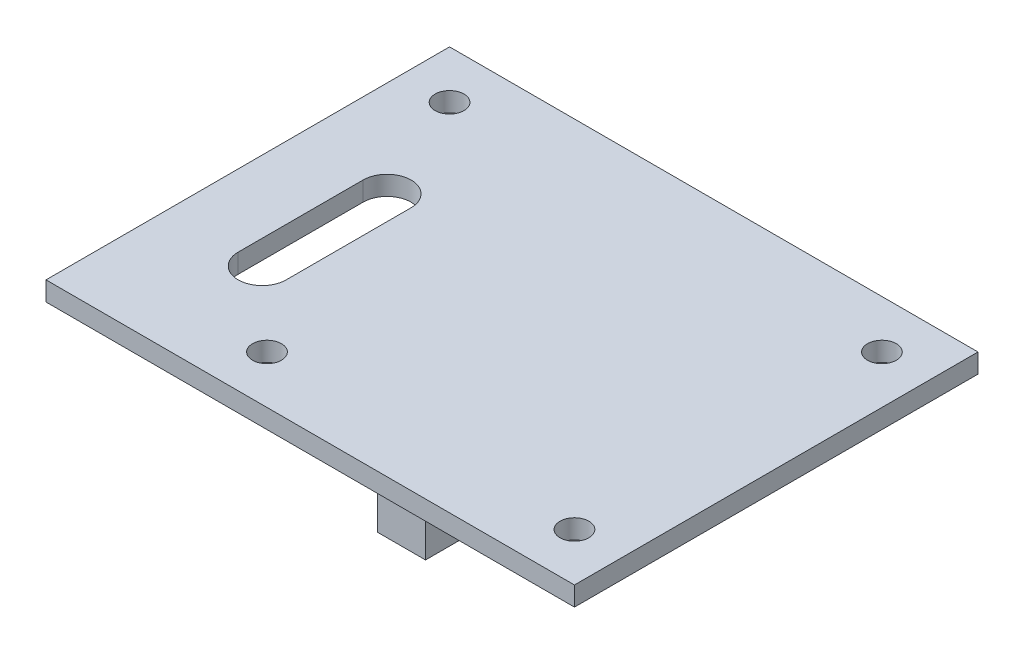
ISO-10303-21;
HEADER;
FILE_DESCRIPTION(('STEP AP214'),'2;1');
FILE_NAME('part.step','',(''),(''),'','','');
FILE_SCHEMA(('AUTOMOTIVE_DESIGN { 1 0 10303 214 1 1 1 1 }'));
ENDSEC;
DATA;
#1=APPLICATION_CONTEXT('core data for automotive mechanical design processes');
#2=APPLICATION_PROTOCOL_DEFINITION('international standard','automotive_design',2000,#1);
#3=PRODUCT_CONTEXT('',#1,'mechanical');
#4=PRODUCT('Part','Part','',(#3));
#5=PRODUCT_RELATED_PRODUCT_CATEGORY('part','',(#4));
#6=PRODUCT_DEFINITION_FORMATION('','',#4);
#7=PRODUCT_DEFINITION_CONTEXT('part definition',#1,'design');
#8=PRODUCT_DEFINITION('design','',#6,#7);
#9=PRODUCT_DEFINITION_SHAPE('','',#8);
#10=(LENGTH_UNIT() NAMED_UNIT(*) SI_UNIT(.MILLI.,.METRE.));
#11=(NAMED_UNIT(*) PLANE_ANGLE_UNIT() SI_UNIT($,.RADIAN.));
#12=(NAMED_UNIT(*) SI_UNIT($,.STERADIAN.) SOLID_ANGLE_UNIT());
#13=UNCERTAINTY_MEASURE_WITH_UNIT(LENGTH_MEASURE(1.E-05),#10,'distance_accuracy_value','');
#14=(GEOMETRIC_REPRESENTATION_CONTEXT(3) GLOBAL_UNCERTAINTY_ASSIGNED_CONTEXT((#13)) GLOBAL_UNIT_ASSIGNED_CONTEXT((#10,
#11,#12)) REPRESENTATION_CONTEXT('',''));
#15=CARTESIAN_POINT('',(0.,0.,0.));
#16=DIRECTION('',(0.,0.,1.));
#17=DIRECTION('',(1.,0.,0.));
#18=AXIS2_PLACEMENT_3D('',#15,#16,#17);
#19=CARTESIAN_POINT('',(0.,0.,0.));
#20=DIRECTION('',(0.,-1.,0.));
#21=DIRECTION('',(0.,0.,-1.));
#22=AXIS2_PLACEMENT_3D('',#19,#20,#21);
#23=PLANE('',#22);
#24=CARTESIAN_POINT('',(50.,0.,-37.));
#25=DIRECTION('',(0.,1.,0.));
#26=DIRECTION('',(0.,0.,1.));
#27=AXIS2_PLACEMENT_3D('',#24,#25,#26);
#28=CIRCLE('',#27,1.5);
#29=CARTESIAN_POINT('',(50.,0.,-35.5));
#30=VERTEX_POINT('',#29);
#31=EDGE_CURVE('E242',#30,#30,#28,.T.);
#32=ORIENTED_EDGE('',*,*,#31,.T.);
#33=EDGE_LOOP('',(#32));
#34=FACE_BOUND('',#33,.T.);
#35=CARTESIAN_POINT('',(18.,0.,-4.99999999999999));
#36=DIRECTION('',(0.,1.,0.));
#37=DIRECTION('',(0.,0.,1.));
#38=AXIS2_PLACEMENT_3D('',#35,#36,#37);
#39=CIRCLE('',#38,1.5);
#40=CARTESIAN_POINT('',(18.,0.,-3.49999999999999));
#41=VERTEX_POINT('',#40);
#42=EDGE_CURVE('E254',#41,#41,#39,.T.);
#43=ORIENTED_EDGE('',*,*,#42,.T.);
#44=EDGE_LOOP('',(#43));
#45=FACE_BOUND('',#44,.T.);
#46=CARTESIAN_POINT('',(50.,0.,-5.));
#47=DIRECTION('',(0.,1.,0.));
#48=DIRECTION('',(0.,0.,1.));
#49=AXIS2_PLACEMENT_3D('',#46,#47,#48);
#50=CIRCLE('',#49,1.5);
#51=CARTESIAN_POINT('',(50.,0.,-3.49999999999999));
#52=VERTEX_POINT('',#51);
#53=EDGE_CURVE('E248',#52,#52,#50,.T.);
#54=ORIENTED_EDGE('',*,*,#53,.T.);
#55=EDGE_LOOP('',(#54));
#56=FACE_BOUND('',#55,.T.);
#57=CARTESIAN_POINT('',(5.,0.,-37.));
#58=DIRECTION('',(0.,1.,0.));
#59=DIRECTION('',(0.,0.,1.));
#60=AXIS2_PLACEMENT_3D('',#57,#58,#59);
#61=CIRCLE('',#60,1.5);
#62=CARTESIAN_POINT('',(5.,0.,-35.5));
#63=VERTEX_POINT('',#62);
#64=EDGE_CURVE('E238',#63,#63,#61,.T.);
#65=ORIENTED_EDGE('',*,*,#64,.T.);
#66=EDGE_LOOP('',(#65));
#67=FACE_BOUND('',#66,.T.);
#68=DIRECTION('',(0.,0.,-1.));
#69=VECTOR('',#68,1.);
#70=CARTESIAN_POINT('',(12.5,0.,-25.5));
#71=LINE('',#70,#69);
#72=CARTESIAN_POINT('',(12.5,0.,-12.5));
#73=VERTEX_POINT('',#72);
#74=CARTESIAN_POINT('',(12.5,0.,-25.5));
#75=VERTEX_POINT('',#74);
#76=EDGE_CURVE('E211',#73,#75,#71,.T.);
#77=ORIENTED_EDGE('',*,*,#76,.T.);
#78=CARTESIAN_POINT('',(10.,0.,-25.5));
#79=DIRECTION('',(0.,1.,0.));
#80=DIRECTION('',(0.,0.,1.));
#81=AXIS2_PLACEMENT_3D('',#78,#79,#80);
#82=CIRCLE('',#81,2.5);
#83=CARTESIAN_POINT('',(7.5,0.,-25.5));
#84=VERTEX_POINT('',#83);
#85=EDGE_CURVE('E207',#75,#84,#82,.T.);
#86=ORIENTED_EDGE('',*,*,#85,.T.);
#87=DIRECTION('',(0.,0.,1.));
#88=VECTOR('',#87,1.);
#89=CARTESIAN_POINT('',(7.5,0.,-25.5));
#90=LINE('',#89,#88);
#91=CARTESIAN_POINT('',(7.5,0.,-12.5));
#92=VERTEX_POINT('',#91);
#93=EDGE_CURVE('E221',#84,#92,#90,.T.);
#94=ORIENTED_EDGE('',*,*,#93,.T.);
#95=CARTESIAN_POINT('',(10.,0.,-12.4999999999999));
#96=DIRECTION('',(0.,1.,0.));
#97=DIRECTION('',(0.,0.,1.));
#98=AXIS2_PLACEMENT_3D('',#95,#96,#97);
#99=CIRCLE('',#98,2.5);
#100=EDGE_CURVE('E224',#92,#73,#99,.T.);
#101=ORIENTED_EDGE('',*,*,#100,.T.);
#102=EDGE_LOOP('',(#77,#86,#94,#101));
#103=FACE_BOUND('',#102,.T.);
#104=DIRECTION('',(0.,0.,1.));
#105=VECTOR('',#104,1.);
#106=CARTESIAN_POINT('',(31.,0.,0.));
#107=LINE('',#106,#105);
#108=CARTESIAN_POINT('',(31.,0.,-13.5));
#109=VERTEX_POINT('',#108);
#110=CARTESIAN_POINT('',(31.,0.,-8.5));
#111=VERTEX_POINT('',#110);
#112=EDGE_CURVE('E178',#109,#111,#107,.T.);
#113=ORIENTED_EDGE('',*,*,#112,.F.);
#114=DIRECTION('',(1.,0.,0.));
#115=VECTOR('',#114,1.);
#116=CARTESIAN_POINT('',(0.,0.,-13.5));
#117=LINE('',#116,#115);
#118=CARTESIAN_POINT('',(26.,0.,-13.5));
#119=VERTEX_POINT('',#118);
#120=EDGE_CURVE('E175',#119,#109,#117,.T.);
#121=ORIENTED_EDGE('',*,*,#120,.F.);
#122=DIRECTION('',(0.,0.,-1.));
#123=VECTOR('',#122,1.);
#124=CARTESIAN_POINT('',(26.,0.,0.));
#125=LINE('',#124,#123);
#126=CARTESIAN_POINT('',(26.,0.,-8.5));
#127=VERTEX_POINT('',#126);
#128=EDGE_CURVE('E188',#127,#119,#125,.T.);
#129=ORIENTED_EDGE('',*,*,#128,.F.);
#130=DIRECTION('',(-1.,0.,0.));
#131=VECTOR('',#130,1.);
#132=CARTESIAN_POINT('',(0.,0.,-8.5));
#133=LINE('',#132,#131);
#134=EDGE_CURVE('E196',#111,#127,#133,.T.);
#135=ORIENTED_EDGE('',*,*,#134,.F.);
#136=EDGE_LOOP('',(#113,#121,#129,#135));
#137=FACE_BOUND('',#136,.T.);
#138=DIRECTION('',(-1.,0.,0.));
#139=VECTOR('',#138,1.);
#140=CARTESIAN_POINT('',(0.,0.,-37.));
#141=LINE('',#140,#139);
#142=CARTESIAN_POINT('',(31.,0.,-37.));
#143=VERTEX_POINT('',#142);
#144=CARTESIAN_POINT('',(26.,0.,-37.));
#145=VERTEX_POINT('',#144);
#146=EDGE_CURVE('E297',#143,#145,#141,.T.);
#147=ORIENTED_EDGE('',*,*,#146,.F.);
#148=DIRECTION('',(0.,0.,1.));
#149=VECTOR('',#148,1.);
#150=CARTESIAN_POINT('',(31.,0.,0.));
#151=LINE('',#150,#149);
#152=CARTESIAN_POINT('',(31.,0.,-42.));
#153=VERTEX_POINT('',#152);
#154=EDGE_CURVE('E295',#153,#143,#151,.T.);
#155=ORIENTED_EDGE('',*,*,#154,.F.);
#156=DIRECTION('',(-1.,0.,0.));
#157=VECTOR('',#156,1.);
#158=CARTESIAN_POINT('',(0.,0.,-42.));
#159=LINE('',#158,#157);
#160=CARTESIAN_POINT('',(55.,0.,-42.));
#161=VERTEX_POINT('',#160);
#162=EDGE_CURVE('E174',#161,#153,#159,.T.);
#163=ORIENTED_EDGE('',*,*,#162,.F.);
#164=DIRECTION('',(0.,0.,-1.));
#165=VECTOR('',#164,1.);
#166=CARTESIAN_POINT('',(55.,0.,0.));
#167=LINE('',#166,#165);
#168=CARTESIAN_POINT('',(55.,0.,0.));
#169=VERTEX_POINT('',#168);
#170=EDGE_CURVE('E277',#169,#161,#167,.T.);
#171=ORIENTED_EDGE('',*,*,#170,.F.);
#172=DIRECTION('',(1.,0.,0.));
#173=VECTOR('',#172,1.);
#174=CARTESIAN_POINT('',(0.,0.,0.));
#175=LINE('',#174,#173);
#176=CARTESIAN_POINT('',(0.,0.,0.));
#177=VERTEX_POINT('',#176);
#178=EDGE_CURVE('E275',#177,#169,#175,.T.);
#179=ORIENTED_EDGE('',*,*,#178,.F.);
#180=DIRECTION('',(0.,0.,1.));
#181=VECTOR('',#180,1.);
#182=CARTESIAN_POINT('',(0.,0.,0.));
#183=LINE('',#182,#181);
#184=CARTESIAN_POINT('',(0.,0.,-42.));
#185=VERTEX_POINT('',#184);
#186=EDGE_CURVE('E260',#185,#177,#183,.T.);
#187=ORIENTED_EDGE('',*,*,#186,.F.);
#188=CARTESIAN_POINT('',(26.,0.,-42.));
#189=VERTEX_POINT('',#188);
#190=EDGE_CURVE('E279',#189,#185,#159,.T.);
#191=ORIENTED_EDGE('',*,*,#190,.F.);
#192=DIRECTION('',(0.,0.,-1.));
#193=VECTOR('',#192,1.);
#194=CARTESIAN_POINT('',(26.,0.,0.));
#195=LINE('',#194,#193);
#196=EDGE_CURVE('E168',#145,#189,#195,.T.);
#197=ORIENTED_EDGE('',*,*,#196,.F.);
#198=EDGE_LOOP('',(#147,#155,#163,#171,#179,#187,#191,#197));
#199=FACE_BOUND('',#198,.T.);
#200=ADVANCED_FACE('F38',(#34,#45,#56,#67,#103,#137,#199),#23,.T.);
#201=CARTESIAN_POINT('',(0.,2.,0.));
#202=DIRECTION('',(0.,-1.,0.));
#203=DIRECTION('',(0.,0.,-1.));
#204=AXIS2_PLACEMENT_3D('',#201,#202,#203);
#205=PLANE('',#204);
#206=CARTESIAN_POINT('',(5.,2.,-37.));
#207=DIRECTION('',(0.,1.,0.));
#208=DIRECTION('',(0.,0.,1.));
#209=AXIS2_PLACEMENT_3D('',#206,#207,#208);
#210=CIRCLE('',#209,1.5);
#211=CARTESIAN_POINT('',(5.,2.,-35.5));
#212=VERTEX_POINT('',#211);
#213=EDGE_CURVE('E239',#212,#212,#210,.T.);
#214=ORIENTED_EDGE('',*,*,#213,.F.);
#215=EDGE_LOOP('',(#214));
#216=FACE_BOUND('',#215,.T.);
#217=CARTESIAN_POINT('',(50.,2.,-37.));
#218=DIRECTION('',(0.,1.,0.));
#219=DIRECTION('',(0.,0.,1.));
#220=AXIS2_PLACEMENT_3D('',#217,#218,#219);
#221=CIRCLE('',#220,1.5);
#222=CARTESIAN_POINT('',(50.,2.,-35.5));
#223=VERTEX_POINT('',#222);
#224=EDGE_CURVE('E245',#223,#223,#221,.T.);
#225=ORIENTED_EDGE('',*,*,#224,.F.);
#226=EDGE_LOOP('',(#225));
#227=FACE_BOUND('',#226,.T.);
#228=CARTESIAN_POINT('',(50.,2.,-5.));
#229=DIRECTION('',(0.,1.,0.));
#230=DIRECTION('',(0.,0.,1.));
#231=AXIS2_PLACEMENT_3D('',#228,#229,#230);
#232=CIRCLE('',#231,1.5);
#233=CARTESIAN_POINT('',(50.,2.,-3.49999999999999));
#234=VERTEX_POINT('',#233);
#235=EDGE_CURVE('E251',#234,#234,#232,.T.);
#236=ORIENTED_EDGE('',*,*,#235,.F.);
#237=EDGE_LOOP('',(#236));
#238=FACE_BOUND('',#237,.T.);
#239=CARTESIAN_POINT('',(18.,2.,-4.99999999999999));
#240=DIRECTION('',(0.,1.,0.));
#241=DIRECTION('',(0.,0.,1.));
#242=AXIS2_PLACEMENT_3D('',#239,#240,#241);
#243=CIRCLE('',#242,1.5);
#244=CARTESIAN_POINT('',(18.,2.,-3.49999999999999));
#245=VERTEX_POINT('',#244);
#246=EDGE_CURVE('E257',#245,#245,#243,.T.);
#247=ORIENTED_EDGE('',*,*,#246,.F.);
#248=EDGE_LOOP('',(#247));
#249=FACE_BOUND('',#248,.T.);
#250=DIRECTION('',(0.,0.,1.));
#251=VECTOR('',#250,1.);
#252=CARTESIAN_POINT('',(0.,2.,0.));
#253=LINE('',#252,#251);
#254=CARTESIAN_POINT('',(0.,2.,-42.));
#255=VERTEX_POINT('',#254);
#256=CARTESIAN_POINT('',(0.,2.,0.));
#257=VERTEX_POINT('',#256);
#258=EDGE_CURVE('E263',#255,#257,#253,.T.);
#259=ORIENTED_EDGE('',*,*,#258,.T.);
#260=DIRECTION('',(1.,0.,0.));
#261=VECTOR('',#260,1.);
#262=CARTESIAN_POINT('',(0.,2.,0.));
#263=LINE('',#262,#261);
#264=CARTESIAN_POINT('',(55.,2.,0.));
#265=VERTEX_POINT('',#264);
#266=EDGE_CURVE('E266',#257,#265,#263,.T.);
#267=ORIENTED_EDGE('',*,*,#266,.T.);
#268=DIRECTION('',(0.,0.,-1.));
#269=VECTOR('',#268,1.);
#270=CARTESIAN_POINT('',(55.,2.,0.));
#271=LINE('',#270,#269);
#272=CARTESIAN_POINT('',(55.,2.,-42.));
#273=VERTEX_POINT('',#272);
#274=EDGE_CURVE('E268',#265,#273,#271,.T.);
#275=ORIENTED_EDGE('',*,*,#274,.T.);
#276=DIRECTION('',(-1.,0.,0.));
#277=VECTOR('',#276,1.);
#278=CARTESIAN_POINT('',(0.,2.,-42.));
#279=LINE('',#278,#277);
#280=EDGE_CURVE('E270',#273,#255,#279,.T.);
#281=ORIENTED_EDGE('',*,*,#280,.T.);
#282=EDGE_LOOP('',(#259,#267,#275,#281));
#283=FACE_BOUND('',#282,.T.);
#284=CARTESIAN_POINT('',(10.,2.,-25.5));
#285=DIRECTION('',(0.,1.,0.));
#286=DIRECTION('',(0.,0.,1.));
#287=AXIS2_PLACEMENT_3D('',#284,#285,#286);
#288=CIRCLE('',#287,2.5);
#289=CARTESIAN_POINT('',(12.5,2.,-25.5));
#290=VERTEX_POINT('',#289);
#291=CARTESIAN_POINT('',(7.5,2.,-25.5));
#292=VERTEX_POINT('',#291);
#293=EDGE_CURVE('E208',#290,#292,#288,.T.);
#294=ORIENTED_EDGE('',*,*,#293,.F.);
#295=DIRECTION('',(0.,0.,-1.));
#296=VECTOR('',#295,1.);
#297=CARTESIAN_POINT('',(12.5,2.,-25.5));
#298=LINE('',#297,#296);
#299=CARTESIAN_POINT('',(12.5,2.,-12.5));
#300=VERTEX_POINT('',#299);
#301=EDGE_CURVE('E216',#300,#290,#298,.T.);
#302=ORIENTED_EDGE('',*,*,#301,.F.);
#303=CARTESIAN_POINT('',(10.,2.,-12.4999999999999));
#304=DIRECTION('',(0.,1.,0.));
#305=DIRECTION('',(0.,0.,1.));
#306=AXIS2_PLACEMENT_3D('',#303,#304,#305);
#307=CIRCLE('',#306,2.5);
#308=CARTESIAN_POINT('',(7.5,2.,-12.5));
#309=VERTEX_POINT('',#308);
#310=EDGE_CURVE('E213',#309,#300,#307,.T.);
#311=ORIENTED_EDGE('',*,*,#310,.F.);
#312=DIRECTION('',(0.,0.,1.));
#313=VECTOR('',#312,1.);
#314=CARTESIAN_POINT('',(7.5,2.,-25.5));
#315=LINE('',#314,#313);
#316=EDGE_CURVE('E210',#292,#309,#315,.T.);
#317=ORIENTED_EDGE('',*,*,#316,.F.);
#318=EDGE_LOOP('',(#294,#302,#311,#317));
#319=FACE_BOUND('',#318,.T.);
#320=ADVANCED_FACE('F320',(#216,#227,#238,#249,#283,#319),#205,.F.);
#321=CARTESIAN_POINT('',(0.,2.,0.));
#322=DIRECTION('',(1.,0.,0.));
#323=DIRECTION('',(0.,0.,-1.));
#324=AXIS2_PLACEMENT_3D('',#321,#322,#323);
#325=PLANE('',#324);
#326=ORIENTED_EDGE('',*,*,#186,.T.);
#327=DIRECTION('',(0.,-1.,0.));
#328=VECTOR('',#327,1.);
#329=CARTESIAN_POINT('',(0.,2.,0.));
#330=LINE('',#329,#328);
#331=EDGE_CURVE('E11',#257,#177,#330,.T.);
#332=ORIENTED_EDGE('',*,*,#331,.F.);
#333=ORIENTED_EDGE('',*,*,#258,.F.);
#334=DIRECTION('',(0.,-1.,0.));
#335=VECTOR('',#334,1.);
#336=CARTESIAN_POINT('',(0.,2.,-42.));
#337=LINE('',#336,#335);
#338=EDGE_CURVE('E272',#255,#185,#337,.T.);
#339=ORIENTED_EDGE('',*,*,#338,.T.);
#340=EDGE_LOOP('',(#326,#332,#333,#339));
#341=FACE_BOUND('',#340,.T.);
#342=ADVANCED_FACE('F40',(#341),#325,.F.);
#343=CARTESIAN_POINT('',(0.,2.,0.));
#344=DIRECTION('',(0.,0.,-1.));
#345=DIRECTION('',(-1.,0.,0.));
#346=AXIS2_PLACEMENT_3D('',#343,#344,#345);
#347=PLANE('',#346);
#348=ORIENTED_EDGE('',*,*,#178,.T.);
#349=DIRECTION('',(0.,-1.,0.));
#350=VECTOR('',#349,1.);
#351=CARTESIAN_POINT('',(55.,2.,0.));
#352=LINE('',#351,#350);
#353=EDGE_CURVE('E46',#265,#169,#352,.T.);
#354=ORIENTED_EDGE('',*,*,#353,.F.);
#355=ORIENTED_EDGE('',*,*,#266,.F.);
#356=ORIENTED_EDGE('',*,*,#331,.T.);
#357=EDGE_LOOP('',(#348,#354,#355,#356));
#358=FACE_BOUND('',#357,.T.);
#359=ADVANCED_FACE('F322',(#358),#347,.F.);
#360=CARTESIAN_POINT('',(55.,2.,0.));
#361=DIRECTION('',(-1.,0.,0.));
#362=DIRECTION('',(0.,0.,1.));
#363=AXIS2_PLACEMENT_3D('',#360,#361,#362);
#364=PLANE('',#363);
#365=ORIENTED_EDGE('',*,*,#170,.T.);
#366=DIRECTION('',(0.,-1.,0.));
#367=VECTOR('',#366,1.);
#368=CARTESIAN_POINT('',(55.,2.,-42.));
#369=LINE('',#368,#367);
#370=EDGE_CURVE('E283',#273,#161,#369,.T.);
#371=ORIENTED_EDGE('',*,*,#370,.F.);
#372=ORIENTED_EDGE('',*,*,#274,.F.);
#373=ORIENTED_EDGE('',*,*,#353,.T.);
#374=EDGE_LOOP('',(#365,#371,#372,#373));
#375=FACE_BOUND('',#374,.T.);
#376=ADVANCED_FACE('F289',(#375),#364,.F.);
#377=CARTESIAN_POINT('',(0.,2.,-42.));
#378=DIRECTION('',(0.,0.,1.));
#379=DIRECTION('',(1.,0.,0.));
#380=AXIS2_PLACEMENT_3D('',#377,#378,#379);
#381=PLANE('',#380);
#382=ORIENTED_EDGE('',*,*,#162,.T.);
#383=DIRECTION('',(0.,1.,0.));
#384=VECTOR('',#383,1.);
#385=CARTESIAN_POINT('',(31.,-12.,-42.));
#386=LINE('',#385,#384);
#387=CARTESIAN_POINT('',(31.,-12.,-42.));
#388=VERTEX_POINT('',#387);
#389=EDGE_CURVE('E156',#388,#153,#386,.T.);
#390=ORIENTED_EDGE('',*,*,#389,.F.);
#391=DIRECTION('',(1.,0.,0.));
#392=VECTOR('',#391,1.);
#393=CARTESIAN_POINT('',(0.,-12.,-42.));
#394=LINE('',#393,#392);
#395=CARTESIAN_POINT('',(26.,-12.,-42.));
#396=VERTEX_POINT('',#395);
#397=EDGE_CURVE('E163',#396,#388,#394,.T.);
#398=ORIENTED_EDGE('',*,*,#397,.F.);
#399=DIRECTION('',(0.,1.,0.));
#400=VECTOR('',#399,1.);
#401=CARTESIAN_POINT('',(26.,-12.,-42.));
#402=LINE('',#401,#400);
#403=EDGE_CURVE('E53',#396,#189,#402,.T.);
#404=ORIENTED_EDGE('',*,*,#403,.T.);
#405=ORIENTED_EDGE('',*,*,#190,.T.);
#406=ORIENTED_EDGE('',*,*,#338,.F.);
#407=ORIENTED_EDGE('',*,*,#280,.F.);
#408=ORIENTED_EDGE('',*,*,#370,.T.);
#409=EDGE_LOOP('',(#382,#390,#398,#404,#405,#406,#407,#408));
#410=FACE_BOUND('',#409,.T.);
#411=ADVANCED_FACE('F171',(#410),#381,.F.);
#412=CARTESIAN_POINT('',(18.,2.,-4.99999999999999));
#413=DIRECTION('',(0.,-1.,0.));
#414=DIRECTION('',(0.,0.,-1.));
#415=AXIS2_PLACEMENT_3D('',#412,#413,#414);
#416=CYLINDRICAL_SURFACE('',#415,1.5);
#417=ORIENTED_EDGE('',*,*,#246,.T.);
#418=EDGE_LOOP('',(#417));
#419=FACE_BOUND('',#418,.T.);
#420=ORIENTED_EDGE('',*,*,#42,.F.);
#421=EDGE_LOOP('',(#420));
#422=FACE_BOUND('',#421,.T.);
#423=ADVANCED_FACE('F341',(#419,#422),#416,.F.);
#424=CARTESIAN_POINT('',(50.,2.,-5.));
#425=DIRECTION('',(0.,-1.,0.));
#426=DIRECTION('',(0.,0.,-1.));
#427=AXIS2_PLACEMENT_3D('',#424,#425,#426);
#428=CYLINDRICAL_SURFACE('',#427,1.5);
#429=ORIENTED_EDGE('',*,*,#235,.T.);
#430=EDGE_LOOP('',(#429));
#431=FACE_BOUND('',#430,.T.);
#432=ORIENTED_EDGE('',*,*,#53,.F.);
#433=EDGE_LOOP('',(#432));
#434=FACE_BOUND('',#433,.T.);
#435=ADVANCED_FACE('F345',(#431,#434),#428,.F.);
#436=CARTESIAN_POINT('',(50.,2.,-37.));
#437=DIRECTION('',(0.,-1.,0.));
#438=DIRECTION('',(0.,0.,-1.));
#439=AXIS2_PLACEMENT_3D('',#436,#437,#438);
#440=CYLINDRICAL_SURFACE('',#439,1.5);
#441=ORIENTED_EDGE('',*,*,#224,.T.);
#442=EDGE_LOOP('',(#441));
#443=FACE_BOUND('',#442,.T.);
#444=ORIENTED_EDGE('',*,*,#31,.F.);
#445=EDGE_LOOP('',(#444));
#446=FACE_BOUND('',#445,.T.);
#447=ADVANCED_FACE('F350',(#443,#446),#440,.F.);
#448=CARTESIAN_POINT('',(5.,2.,-37.));
#449=DIRECTION('',(0.,-1.,0.));
#450=DIRECTION('',(0.,0.,-1.));
#451=AXIS2_PLACEMENT_3D('',#448,#449,#450);
#452=CYLINDRICAL_SURFACE('',#451,1.5);
#453=ORIENTED_EDGE('',*,*,#213,.T.);
#454=EDGE_LOOP('',(#453));
#455=FACE_BOUND('',#454,.T.);
#456=ORIENTED_EDGE('',*,*,#64,.F.);
#457=EDGE_LOOP('',(#456));
#458=FACE_BOUND('',#457,.T.);
#459=ADVANCED_FACE('F357',(#455,#458),#452,.F.);
#460=CARTESIAN_POINT('',(10.,2.,-25.5));
#461=DIRECTION('',(0.,-1.,0.));
#462=DIRECTION('',(0.,0.,-1.));
#463=AXIS2_PLACEMENT_3D('',#460,#461,#462);
#464=CYLINDRICAL_SURFACE('',#463,2.5);
#465=ORIENTED_EDGE('',*,*,#85,.F.);
#466=DIRECTION('',(0.,-1.,0.));
#467=VECTOR('',#466,1.);
#468=CARTESIAN_POINT('',(12.5,2.,-25.5));
#469=LINE('',#468,#467);
#470=EDGE_CURVE('E218',#290,#75,#469,.T.);
#471=ORIENTED_EDGE('',*,*,#470,.F.);
#472=ORIENTED_EDGE('',*,*,#293,.T.);
#473=DIRECTION('',(0.,-1.,0.));
#474=VECTOR('',#473,1.);
#475=CARTESIAN_POINT('',(7.5,2.,-25.5));
#476=LINE('',#475,#474);
#477=EDGE_CURVE('E235',#292,#84,#476,.T.);
#478=ORIENTED_EDGE('',*,*,#477,.T.);
#479=EDGE_LOOP('',(#465,#471,#472,#478));
#480=FACE_BOUND('',#479,.T.);
#481=ADVANCED_FACE('F361',(#480),#464,.F.);
#482=CARTESIAN_POINT('',(7.5,2.,-25.5));
#483=DIRECTION('',(1.,0.,0.));
#484=DIRECTION('',(0.,0.,-1.));
#485=AXIS2_PLACEMENT_3D('',#482,#483,#484);
#486=PLANE('',#485);
#487=ORIENTED_EDGE('',*,*,#93,.F.);
#488=ORIENTED_EDGE('',*,*,#477,.F.);
#489=ORIENTED_EDGE('',*,*,#316,.T.);
#490=DIRECTION('',(0.,-1.,0.));
#491=VECTOR('',#490,1.);
#492=CARTESIAN_POINT('',(7.5,2.,-12.5));
#493=LINE('',#492,#491);
#494=EDGE_CURVE('E233',#309,#92,#493,.T.);
#495=ORIENTED_EDGE('',*,*,#494,.T.);
#496=EDGE_LOOP('',(#487,#488,#489,#495));
#497=FACE_BOUND('',#496,.T.);
#498=ADVANCED_FACE('F365',(#497),#486,.T.);
#499=CARTESIAN_POINT('',(10.,2.,-12.4999999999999));
#500=DIRECTION('',(0.,-1.,0.));
#501=DIRECTION('',(0.,0.,-1.));
#502=AXIS2_PLACEMENT_3D('',#499,#500,#501);
#503=CYLINDRICAL_SURFACE('',#502,2.5);
#504=ORIENTED_EDGE('',*,*,#100,.F.);
#505=ORIENTED_EDGE('',*,*,#494,.F.);
#506=ORIENTED_EDGE('',*,*,#310,.T.);
#507=DIRECTION('',(0.,-1.,0.));
#508=VECTOR('',#507,1.);
#509=CARTESIAN_POINT('',(12.5,2.,-12.5));
#510=LINE('',#509,#508);
#511=EDGE_CURVE('E231',#300,#73,#510,.T.);
#512=ORIENTED_EDGE('',*,*,#511,.T.);
#513=EDGE_LOOP('',(#504,#505,#506,#512));
#514=FACE_BOUND('',#513,.T.);
#515=ADVANCED_FACE('F369',(#514),#503,.F.);
#516=CARTESIAN_POINT('',(12.5,2.,-25.5));
#517=DIRECTION('',(-1.,0.,0.));
#518=DIRECTION('',(0.,0.,1.));
#519=AXIS2_PLACEMENT_3D('',#516,#517,#518);
#520=PLANE('',#519);
#521=ORIENTED_EDGE('',*,*,#76,.F.);
#522=ORIENTED_EDGE('',*,*,#511,.F.);
#523=ORIENTED_EDGE('',*,*,#301,.T.);
#524=ORIENTED_EDGE('',*,*,#470,.T.);
#525=EDGE_LOOP('',(#521,#522,#523,#524));
#526=FACE_BOUND('',#525,.T.);
#527=ADVANCED_FACE('F373',(#526),#520,.T.);
#528=CARTESIAN_POINT('',(0.,-12.,-13.5));
#529=DIRECTION('',(0.,0.,1.));
#530=DIRECTION('',(1.,0.,0.));
#531=AXIS2_PLACEMENT_3D('',#528,#529,#530);
#532=PLANE('',#531);
#533=ORIENTED_EDGE('',*,*,#120,.T.);
#534=DIRECTION('',(0.,1.,0.));
#535=VECTOR('',#534,1.);
#536=CARTESIAN_POINT('',(31.,-12.,-13.5));
#537=LINE('',#536,#535);
#538=CARTESIAN_POINT('',(31.,-12.,-13.5));
#539=VERTEX_POINT('',#538);
#540=EDGE_CURVE('E205',#539,#109,#537,.T.);
#541=ORIENTED_EDGE('',*,*,#540,.F.);
#542=DIRECTION('',(1.,0.,0.));
#543=VECTOR('',#542,1.);
#544=CARTESIAN_POINT('',(0.,-12.,-13.5));
#545=LINE('',#544,#543);
#546=CARTESIAN_POINT('',(26.,-12.,-13.5));
#547=VERTEX_POINT('',#546);
#548=EDGE_CURVE('E184',#547,#539,#545,.T.);
#549=ORIENTED_EDGE('',*,*,#548,.F.);
#550=DIRECTION('',(0.,1.,0.));
#551=VECTOR('',#550,1.);
#552=CARTESIAN_POINT('',(26.,-12.,-13.5));
#553=LINE('',#552,#551);
#554=EDGE_CURVE('E193',#547,#119,#553,.T.);
#555=ORIENTED_EDGE('',*,*,#554,.T.);
#556=EDGE_LOOP('',(#533,#541,#549,#555));
#557=FACE_BOUND('',#556,.T.);
#558=ADVANCED_FACE('F377',(#557),#532,.F.);
#559=CARTESIAN_POINT('',(31.,-12.,0.));
#560=DIRECTION('',(-1.,0.,0.));
#561=DIRECTION('',(0.,0.,1.));
#562=AXIS2_PLACEMENT_3D('',#559,#560,#561);
#563=PLANE('',#562);
#564=CARTESIAN_POINT('',(31.,-6.,-11.));
#565=DIRECTION('',(-1.,0.,0.));
#566=DIRECTION('',(0.,0.,1.));
#567=AXIS2_PLACEMENT_3D('',#564,#565,#566);
#568=CIRCLE('',#567,1.);
#569=CARTESIAN_POINT('',(31.,-6.,-10.));
#570=VERTEX_POINT('',#569);
#571=EDGE_CURVE('E298',#570,#570,#568,.T.);
#572=ORIENTED_EDGE('',*,*,#571,.T.);
#573=EDGE_LOOP('',(#572));
#574=FACE_BOUND('',#573,.T.);
#575=ORIENTED_EDGE('',*,*,#112,.T.);
#576=DIRECTION('',(0.,1.,0.));
#577=VECTOR('',#576,1.);
#578=CARTESIAN_POINT('',(31.,-12.,-8.5));
#579=LINE('',#578,#577);
#580=CARTESIAN_POINT('',(31.,-12.,-8.5));
#581=VERTEX_POINT('',#580);
#582=EDGE_CURVE('E202',#581,#111,#579,.T.);
#583=ORIENTED_EDGE('',*,*,#582,.F.);
#584=DIRECTION('',(0.,0.,1.));
#585=VECTOR('',#584,1.);
#586=CARTESIAN_POINT('',(31.,-12.,0.));
#587=LINE('',#586,#585);
#588=EDGE_CURVE('E187',#539,#581,#587,.T.);
#589=ORIENTED_EDGE('',*,*,#588,.F.);
#590=ORIENTED_EDGE('',*,*,#540,.T.);
#591=EDGE_LOOP('',(#575,#583,#589,#590));
#592=FACE_BOUND('',#591,.T.);
#593=ADVANCED_FACE('F381',(#574,#592),#563,.F.);
#594=CARTESIAN_POINT('',(0.,-12.,-8.5));
#595=DIRECTION('',(0.,0.,-1.));
#596=DIRECTION('',(-1.,0.,0.));
#597=AXIS2_PLACEMENT_3D('',#594,#595,#596);
#598=PLANE('',#597);
#599=ORIENTED_EDGE('',*,*,#134,.T.);
#600=DIRECTION('',(0.,1.,0.));
#601=VECTOR('',#600,1.);
#602=CARTESIAN_POINT('',(26.,-12.,-8.5));
#603=LINE('',#602,#601);
#604=CARTESIAN_POINT('',(26.,-12.,-8.5));
#605=VERTEX_POINT('',#604);
#606=EDGE_CURVE('E61',#605,#127,#603,.T.);
#607=ORIENTED_EDGE('',*,*,#606,.F.);
#608=DIRECTION('',(-1.,0.,0.));
#609=VECTOR('',#608,1.);
#610=CARTESIAN_POINT('',(0.,-12.,-8.5));
#611=LINE('',#610,#609);
#612=EDGE_CURVE('E190',#581,#605,#611,.T.);
#613=ORIENTED_EDGE('',*,*,#612,.F.);
#614=ORIENTED_EDGE('',*,*,#582,.T.);
#615=EDGE_LOOP('',(#599,#607,#613,#614));
#616=FACE_BOUND('',#615,.T.);
#617=ADVANCED_FACE('F385',(#616),#598,.F.);
#618=CARTESIAN_POINT('',(26.,-12.,0.));
#619=DIRECTION('',(1.,0.,0.));
#620=DIRECTION('',(0.,0.,-1.));
#621=AXIS2_PLACEMENT_3D('',#618,#619,#620);
#622=PLANE('',#621);
#623=CARTESIAN_POINT('',(26.,-6.,-11.));
#624=DIRECTION('',(-1.,0.,0.));
#625=DIRECTION('',(0.,0.,1.));
#626=AXIS2_PLACEMENT_3D('',#623,#624,#625);
#627=CIRCLE('',#626,1.);
#628=CARTESIAN_POINT('',(26.,-6.,-10.));
#629=VERTEX_POINT('',#628);
#630=EDGE_CURVE('E421',#629,#629,#627,.T.);
#631=ORIENTED_EDGE('',*,*,#630,.F.);
#632=EDGE_LOOP('',(#631));
#633=FACE_BOUND('',#632,.T.);
#634=ORIENTED_EDGE('',*,*,#128,.T.);
#635=ORIENTED_EDGE('',*,*,#554,.F.);
#636=DIRECTION('',(0.,0.,-1.));
#637=VECTOR('',#636,1.);
#638=CARTESIAN_POINT('',(26.,-12.,0.));
#639=LINE('',#638,#637);
#640=EDGE_CURVE('E192',#605,#547,#639,.T.);
#641=ORIENTED_EDGE('',*,*,#640,.F.);
#642=ORIENTED_EDGE('',*,*,#606,.T.);
#643=EDGE_LOOP('',(#634,#635,#641,#642));
#644=FACE_BOUND('',#643,.T.);
#645=ADVANCED_FACE('F389',(#633,#644),#622,.F.);
#646=CARTESIAN_POINT('',(0.,-12.,0.));
#647=DIRECTION('',(0.,-1.,0.));
#648=DIRECTION('',(0.,0.,-1.));
#649=AXIS2_PLACEMENT_3D('',#646,#647,#648);
#650=PLANE('',#649);
#651=ORIENTED_EDGE('',*,*,#548,.T.);
#652=ORIENTED_EDGE('',*,*,#588,.T.);
#653=ORIENTED_EDGE('',*,*,#612,.T.);
#654=ORIENTED_EDGE('',*,*,#640,.T.);
#655=EDGE_LOOP('',(#651,#652,#653,#654));
#656=FACE_BOUND('',#655,.T.);
#657=ADVANCED_FACE('F393',(#656),#650,.T.);
#658=CARTESIAN_POINT('',(31.,-12.,0.));
#659=DIRECTION('',(-1.,0.,0.));
#660=DIRECTION('',(0.,0.,1.));
#661=AXIS2_PLACEMENT_3D('',#658,#659,#660);
#662=PLANE('',#661);
#663=CARTESIAN_POINT('',(31.,-6.,-39.5));
#664=DIRECTION('',(-1.,0.,0.));
#665=DIRECTION('',(0.,0.,1.));
#666=AXIS2_PLACEMENT_3D('',#663,#664,#665);
#667=CIRCLE('',#666,0.999999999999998);
#668=CARTESIAN_POINT('',(31.,-6.,-38.5));
#669=VERTEX_POINT('',#668);
#670=EDGE_CURVE('E302',#669,#669,#667,.T.);
#671=ORIENTED_EDGE('',*,*,#670,.T.);
#672=EDGE_LOOP('',(#671));
#673=FACE_BOUND('',#672,.T.);
#674=ORIENTED_EDGE('',*,*,#154,.T.);
#675=DIRECTION('',(0.,1.,0.));
#676=VECTOR('',#675,1.);
#677=CARTESIAN_POINT('',(31.,-12.,-37.));
#678=LINE('',#677,#676);
#679=CARTESIAN_POINT('',(31.,-12.,-37.));
#680=VERTEX_POINT('',#679);
#681=EDGE_CURVE('E159',#680,#143,#678,.T.);
#682=ORIENTED_EDGE('',*,*,#681,.F.);
#683=DIRECTION('',(0.,0.,1.));
#684=VECTOR('',#683,1.);
#685=CARTESIAN_POINT('',(31.,-12.,0.));
#686=LINE('',#685,#684);
#687=EDGE_CURVE('E152',#388,#680,#686,.T.);
#688=ORIENTED_EDGE('',*,*,#687,.F.);
#689=ORIENTED_EDGE('',*,*,#389,.T.);
#690=EDGE_LOOP('',(#674,#682,#688,#689));
#691=FACE_BOUND('',#690,.T.);
#692=ADVANCED_FACE('F154',(#673,#691),#662,.F.);
#693=CARTESIAN_POINT('',(0.,-12.,-37.));
#694=DIRECTION('',(0.,0.,-1.));
#695=DIRECTION('',(-1.,0.,0.));
#696=AXIS2_PLACEMENT_3D('',#693,#694,#695);
#697=PLANE('',#696);
#698=ORIENTED_EDGE('',*,*,#146,.T.);
#699=DIRECTION('',(0.,1.,0.));
#700=VECTOR('',#699,1.);
#701=CARTESIAN_POINT('',(26.,-12.,-37.));
#702=LINE('',#701,#700);
#703=CARTESIAN_POINT('',(26.,-12.,-37.));
#704=VERTEX_POINT('',#703);
#705=EDGE_CURVE('E180',#704,#145,#702,.T.);
#706=ORIENTED_EDGE('',*,*,#705,.F.);
#707=DIRECTION('',(-1.,0.,0.));
#708=VECTOR('',#707,1.);
#709=CARTESIAN_POINT('',(0.,-12.,-37.));
#710=LINE('',#709,#708);
#711=EDGE_CURVE('E162',#680,#704,#710,.T.);
#712=ORIENTED_EDGE('',*,*,#711,.F.);
#713=ORIENTED_EDGE('',*,*,#681,.T.);
#714=EDGE_LOOP('',(#698,#706,#712,#713));
#715=FACE_BOUND('',#714,.T.);
#716=ADVANCED_FACE('F400',(#715),#697,.F.);
#717=CARTESIAN_POINT('',(26.,-12.,0.));
#718=DIRECTION('',(1.,0.,0.));
#719=DIRECTION('',(0.,0.,-1.));
#720=AXIS2_PLACEMENT_3D('',#717,#718,#719);
#721=PLANE('',#720);
#722=CARTESIAN_POINT('',(26.,-6.,-39.5));
#723=DIRECTION('',(-1.,0.,0.));
#724=DIRECTION('',(0.,0.,1.));
#725=AXIS2_PLACEMENT_3D('',#722,#723,#724);
#726=CIRCLE('',#725,0.999999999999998);
#727=CARTESIAN_POINT('',(26.,-6.,-38.5));
#728=VERTEX_POINT('',#727);
#729=EDGE_CURVE('E434',#728,#728,#726,.T.);
#730=ORIENTED_EDGE('',*,*,#729,.F.);
#731=EDGE_LOOP('',(#730));
#732=FACE_BOUND('',#731,.T.);
#733=ORIENTED_EDGE('',*,*,#196,.T.);
#734=ORIENTED_EDGE('',*,*,#403,.F.);
#735=DIRECTION('',(0.,0.,-1.));
#736=VECTOR('',#735,1.);
#737=CARTESIAN_POINT('',(26.,-12.,0.));
#738=LINE('',#737,#736);
#739=EDGE_CURVE('E167',#704,#396,#738,.T.);
#740=ORIENTED_EDGE('',*,*,#739,.F.);
#741=ORIENTED_EDGE('',*,*,#705,.T.);
#742=EDGE_LOOP('',(#733,#734,#740,#741));
#743=FACE_BOUND('',#742,.T.);
#744=ADVANCED_FACE('F311',(#732,#743),#721,.F.);
#745=CARTESIAN_POINT('',(0.,-12.,0.));
#746=DIRECTION('',(0.,-1.,0.));
#747=DIRECTION('',(0.,0.,-1.));
#748=AXIS2_PLACEMENT_3D('',#745,#746,#747);
#749=PLANE('',#748);
#750=ORIENTED_EDGE('',*,*,#397,.T.);
#751=ORIENTED_EDGE('',*,*,#687,.T.);
#752=ORIENTED_EDGE('',*,*,#711,.T.);
#753=ORIENTED_EDGE('',*,*,#739,.T.);
#754=EDGE_LOOP('',(#750,#751,#752,#753));
#755=FACE_BOUND('',#754,.T.);
#756=ADVANCED_FACE('F165',(#755),#749,.T.);
#757=CARTESIAN_POINT('',(32.,-6.,-39.5));
#758=DIRECTION('',(-1.,0.,0.));
#759=DIRECTION('',(0.,0.,1.));
#760=AXIS2_PLACEMENT_3D('',#757,#758,#759);
#761=CYLINDRICAL_SURFACE('',#760,0.999999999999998);
#762=ORIENTED_EDGE('',*,*,#729,.T.);
#763=EDGE_LOOP('',(#762));
#764=FACE_BOUND('',#763,.T.);
#765=ORIENTED_EDGE('',*,*,#670,.F.);
#766=EDGE_LOOP('',(#765));
#767=FACE_BOUND('',#766,.T.);
#768=ADVANCED_FACE('F409',(#764,#767),#761,.F.);
#769=CARTESIAN_POINT('',(32.,-6.,-11.));
#770=DIRECTION('',(-1.,0.,0.));
#771=DIRECTION('',(0.,0.,1.));
#772=AXIS2_PLACEMENT_3D('',#769,#770,#771);
#773=CYLINDRICAL_SURFACE('',#772,1.);
#774=ORIENTED_EDGE('',*,*,#630,.T.);
#775=EDGE_LOOP('',(#774));
#776=FACE_BOUND('',#775,.T.);
#777=ORIENTED_EDGE('',*,*,#571,.F.);
#778=EDGE_LOOP('',(#777));
#779=FACE_BOUND('',#778,.T.);
#780=ADVANCED_FACE('F412',(#776,#779),#773,.F.);
#781=CLOSED_SHELL('',(#200,#320,#342,#359,#376,#411,#423,#435,#447,#459,#481,#498,#515,#527,
#558,#593,#617,#645,#657,#692,#716,#744,#756,#768,#780));
#782=MANIFOLD_SOLID_BREP('B2',#781);
#783=ADVANCED_BREP_SHAPE_REPRESENTATION('',(#18,#782),#14);
#784=SHAPE_DEFINITION_REPRESENTATION(#9,#783);
ENDSEC;
END-ISO-10303-21;
